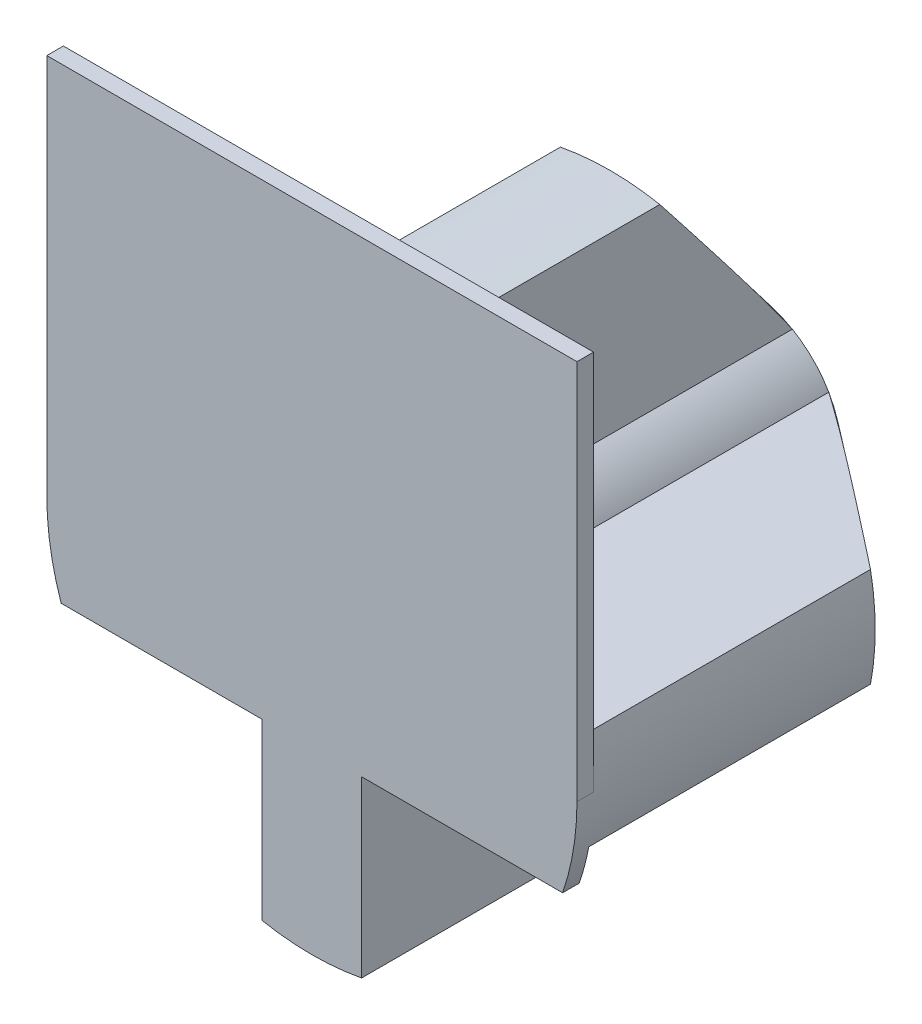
from build123d import *

# Parameters (mm, degrees)
AUFSATZ_LINEAR_AUSTRAGEN2_DEPTH = 13
SCHNITT_LINEAR_AUSTRAGEN1_DEPTH = 8
AUFSATZ_LINEAR_START            = -0.5
AUFSATZ_LINEAR_AUSTRAGEN3_DEPTH = 0.5


with BuildPart() as part:
    # Skizze4 → Aufsatz-Linear austragen2 (new body)
    with BuildSketch(Plane.XY):
        with BuildLine():
            Line((1.5, 7.858116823), (1.5, 2.598076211))
            ThreePointArc((1.5, 2.598076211), (2.121320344, 2.121320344), (2.598076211, 1.5))
            Line((2.598076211, 1.5), (7.858116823, 1.5))
            ThreePointArc((7.858116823, 1.5), (8, 0), (7.858116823, -1.5))
            Line((7.858116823, -1.5), (2.598076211, -1.5))
            ThreePointArc((2.598076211, -1.5), (2.121320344, -2.121320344), (1.5, -2.598076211))
            Line((1.5, -2.598076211), (1.5, -7.858116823))
            ThreePointArc((1.5, -7.858116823), (0, -8), (-1.5, -7.858116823))
            Line((-1.5, -7.858116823), (-1.5, -2.598076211))
            ThreePointArc((-1.5, -2.598076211), (-2.121320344, -2.121320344), (-2.598076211, -1.5))
            Line((-2.598076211, -1.5), (-7.858116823, -1.5))
            ThreePointArc((-7.858116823, -1.5), (-8, 0), (-7.858116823, 1.5))
            Line((-7.858116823, 1.5), (-2.598076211, 1.5))
            ThreePointArc((-2.598076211, 1.5), (-2.121320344, 2.121320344), (-1.5, 2.598076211))
            Line((-1.5, 2.598076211), (-1.5, 7.858116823))
            ThreePointArc((-1.5, 7.858116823), (0, 8), (1.5, 7.858116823))
        make_face()
    extrude(amount=AUFSATZ_LINEAR_AUSTRAGEN2_DEPTH)

    # Skizze5 → Schnitt-Rotation1 (revolve, cut)
    with BuildSketch(Plane(origin=(0, 0, 0), x_dir=(0, 0, -1), z_dir=(1, 0, 0))):
        Polygon((-4, 8), (0, 8), (0, 3), align=None)
    revolve(axis=Axis((0, 0, 0), (0, 0, 1)), mode=Mode.SUBTRACT)

    # Skizze6 → Schnitt-Linear austragen1 (cut)
    with BuildSketch(Plane(origin=(0, 0, 0), x_dir=(-1, 0, 0), z_dir=(0, 0, -1))):
        with BuildLine():
            Line((-0.8, 2.368543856), (-0.8, 1.2))
            ThreePointArc((-0.8, 1.2), (-0.917157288, 0.917157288), (-1.2, 0.8))
            Line((-1.2, 0.8), (-2.368543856, 0.8))
            ThreePointArc((-2.368543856, 0.8), (-2.5, 0), (-2.368543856, -0.8))
            Line((-2.368543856, -0.8), (-1.2, -0.8))
            ThreePointArc((-1.2, -0.8), (-0.917157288, -0.917157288), (-0.8, -1.2))
            Line((-0.8, -1.2), (-0.8, -2.368543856))
            ThreePointArc((-0.8, -2.368543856), (0, -2.5), (0.8, -2.368543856))
            Line((0.8, -2.368543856), (0.8, -1.2))
            ThreePointArc((0.8, -1.2), (0.917157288, -0.917157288), (1.2, -0.8))
            Line((1.2, -0.8), (2.368543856, -0.8))
            ThreePointArc((2.368543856, -0.8), (2.5, 0), (2.368543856, 0.8))
            Line((2.368543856, 0.8), (1.2, 0.8))
            ThreePointArc((1.2, 0.8), (0.917157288, 0.917157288), (0.8, 1.2))
            Line((0.8, 1.2), (0.8, 2.368543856))
            ThreePointArc((0.8, 2.368543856), (0, 2.5), (-0.8, 2.368543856))
        make_face()
    extrude(amount=-SCHNITT_LINEAR_AUSTRAGEN1_DEPTH, mode=Mode.SUBTRACT)

    # Skizze7 → Aufsatz-Linear austragen3 (add)
    with BuildSketch(Plane.XY.offset(13).offset(AUFSATZ_LINEAR_START)):
        with BuildLine():
            Line((-7.566372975, -2.598076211), (7.566372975, -2.598076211))
            ThreePointArc((7.566372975, -2.598076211), (7.890848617, -1.317007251), (8, 0))
            Line((8, 0), (8, 11.5))
            Line((8, 11.5), (-8, 11.5))
            Line((-8, 11.5), (-8, 0))
            ThreePointArc((-8, 0), (-7.890848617, -1.317007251), (-7.566372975, -2.598076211))
        make_face()
    extrude(amount=AUFSATZ_LINEAR_AUSTRAGEN3_DEPTH)


solid = part.part
